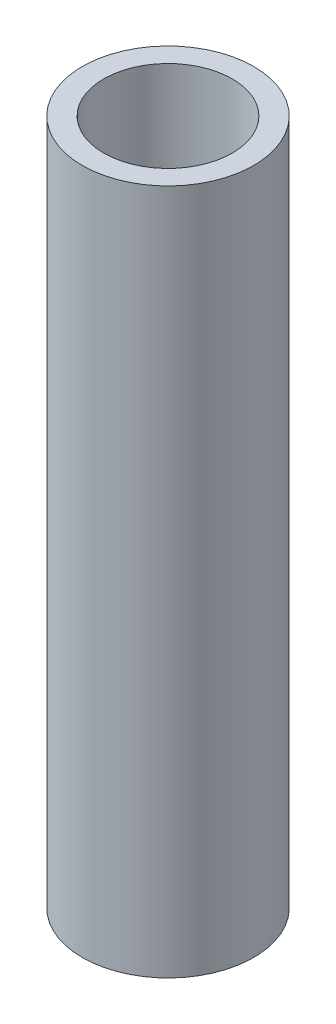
ISO-10303-21;
HEADER;
FILE_DESCRIPTION(('STEP AP214'),'2;1');
FILE_NAME('part.step','',(''),(''),'','','');
FILE_SCHEMA(('AUTOMOTIVE_DESIGN { 1 0 10303 214 1 1 1 1 }'));
ENDSEC;
DATA;
#1=APPLICATION_CONTEXT('core data for automotive mechanical design processes');
#2=APPLICATION_PROTOCOL_DEFINITION('international standard','automotive_design',2000,#1);
#3=PRODUCT_CONTEXT('',#1,'mechanical');
#4=PRODUCT('Part','Part','',(#3));
#5=PRODUCT_RELATED_PRODUCT_CATEGORY('part','',(#4));
#6=PRODUCT_DEFINITION_FORMATION('','',#4);
#7=PRODUCT_DEFINITION_CONTEXT('part definition',#1,'design');
#8=PRODUCT_DEFINITION('design','',#6,#7);
#9=PRODUCT_DEFINITION_SHAPE('','',#8);
#10=(LENGTH_UNIT() NAMED_UNIT(*) SI_UNIT(.MILLI.,.METRE.));
#11=(NAMED_UNIT(*) PLANE_ANGLE_UNIT() SI_UNIT($,.RADIAN.));
#12=(NAMED_UNIT(*) SI_UNIT($,.STERADIAN.) SOLID_ANGLE_UNIT());
#13=UNCERTAINTY_MEASURE_WITH_UNIT(LENGTH_MEASURE(1.E-05),#10,'distance_accuracy_value','');
#14=(GEOMETRIC_REPRESENTATION_CONTEXT(3) GLOBAL_UNCERTAINTY_ASSIGNED_CONTEXT((#13)) GLOBAL_UNIT_ASSIGNED_CONTEXT((#10,
#11,#12)) REPRESENTATION_CONTEXT('',''));
#15=CARTESIAN_POINT('',(0.,0.,0.));
#16=DIRECTION('',(0.,0.,1.));
#17=DIRECTION('',(1.,0.,0.));
#18=AXIS2_PLACEMENT_3D('',#15,#16,#17);
#19=CARTESIAN_POINT('',(0.,203.2,0.));
#20=DIRECTION('',(0.,1.,0.));
#21=DIRECTION('',(0.,0.,1.));
#22=AXIS2_PLACEMENT_3D('',#19,#20,#21);
#23=PLANE('',#22);
#24=CARTESIAN_POINT('',(0.,203.2,0.));
#25=DIRECTION('',(0.,1.,0.));
#26=DIRECTION('',(0.,0.,1.));
#27=AXIS2_PLACEMENT_3D('',#24,#25,#26);
#28=CIRCLE('',#27,25.4);
#29=CARTESIAN_POINT('',(0.,203.2,25.4));
#30=VERTEX_POINT('',#29);
#31=EDGE_CURVE('E10',#30,#30,#28,.T.);
#32=ORIENTED_EDGE('',*,*,#31,.T.);
#33=EDGE_LOOP('',(#32));
#34=FACE_BOUND('',#33,.T.);
#35=CARTESIAN_POINT('',(0.,203.2,0.));
#36=DIRECTION('',(0.,1.,0.));
#37=DIRECTION('',(0.,0.,1.));
#38=AXIS2_PLACEMENT_3D('',#35,#36,#37);
#39=CIRCLE('',#38,19.05);
#40=CARTESIAN_POINT('',(0.,203.2,19.05));
#41=VERTEX_POINT('',#40);
#42=EDGE_CURVE('E56',#41,#41,#39,.T.);
#43=ORIENTED_EDGE('',*,*,#42,.F.);
#44=EDGE_LOOP('',(#43));
#45=FACE_BOUND('',#44,.T.);
#46=ADVANCED_FACE('F43',(#34,#45),#23,.T.);
#47=CARTESIAN_POINT('',(0.,0.,0.));
#48=DIRECTION('',(0.,1.,0.));
#49=DIRECTION('',(0.,0.,1.));
#50=AXIS2_PLACEMENT_3D('',#47,#48,#49);
#51=PLANE('',#50);
#52=CARTESIAN_POINT('',(0.,0.,0.));
#53=DIRECTION('',(0.,1.,0.));
#54=DIRECTION('',(0.,0.,1.));
#55=AXIS2_PLACEMENT_3D('',#52,#53,#54);
#56=CIRCLE('',#55,25.4);
#57=CARTESIAN_POINT('',(0.,0.,25.4));
#58=VERTEX_POINT('',#57);
#59=EDGE_CURVE('E47',#58,#58,#56,.T.);
#60=ORIENTED_EDGE('',*,*,#59,.F.);
#61=EDGE_LOOP('',(#60));
#62=FACE_BOUND('',#61,.T.);
#63=CARTESIAN_POINT('',(0.,0.,0.));
#64=DIRECTION('',(0.,1.,0.));
#65=DIRECTION('',(0.,0.,1.));
#66=AXIS2_PLACEMENT_3D('',#63,#64,#65);
#67=CIRCLE('',#66,19.05);
#68=CARTESIAN_POINT('',(0.,0.,19.05));
#69=VERTEX_POINT('',#68);
#70=EDGE_CURVE('E58',#69,#69,#67,.T.);
#71=ORIENTED_EDGE('',*,*,#70,.T.);
#72=EDGE_LOOP('',(#71));
#73=FACE_BOUND('',#72,.T.);
#74=ADVANCED_FACE('F70',(#62,#73),#51,.F.);
#75=CARTESIAN_POINT('',(0.,203.2,0.));
#76=DIRECTION('',(0.,-1.,0.));
#77=DIRECTION('',(0.,0.,-1.));
#78=AXIS2_PLACEMENT_3D('',#75,#76,#77);
#79=CYLINDRICAL_SURFACE('',#78,25.4);
#80=ORIENTED_EDGE('',*,*,#31,.F.);
#81=EDGE_LOOP('',(#80));
#82=FACE_BOUND('',#81,.T.);
#83=ORIENTED_EDGE('',*,*,#59,.T.);
#84=EDGE_LOOP('',(#83));
#85=FACE_BOUND('',#84,.T.);
#86=ADVANCED_FACE('F45',(#82,#85),#79,.T.);
#87=CARTESIAN_POINT('',(0.,203.2,0.));
#88=DIRECTION('',(0.,-1.,0.));
#89=DIRECTION('',(0.,0.,-1.));
#90=AXIS2_PLACEMENT_3D('',#87,#88,#89);
#91=CYLINDRICAL_SURFACE('',#90,19.05);
#92=ORIENTED_EDGE('',*,*,#42,.T.);
#93=EDGE_LOOP('',(#92));
#94=FACE_BOUND('',#93,.T.);
#95=ORIENTED_EDGE('',*,*,#70,.F.);
#96=EDGE_LOOP('',(#95));
#97=FACE_BOUND('',#96,.T.);
#98=ADVANCED_FACE('F66',(#94,#97),#91,.F.);
#99=CLOSED_SHELL('',(#46,#74,#86,#98));
#100=MANIFOLD_SOLID_BREP('B2',#99);
#101=ADVANCED_BREP_SHAPE_REPRESENTATION('',(#18,#100),#14);
#102=SHAPE_DEFINITION_REPRESENTATION(#9,#101);
ENDSEC;
END-ISO-10303-21;
